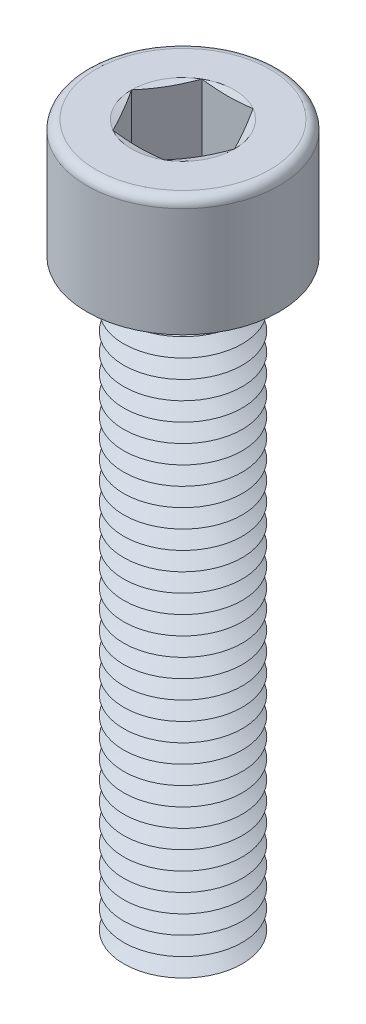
from build123d import *

# Parameters (mm, degrees)
SKETCH1_R       = 4
EXTRUDE1_DEPTH  = 40
SKETCH2_R       = 6.5
EXTRUDE2_DEPTH  = 8
EXTRUDE3_DEPTH  = 6
FILLET1_R       = 0.625
LPATTERN1_COUNT = 32
LPATTERN1_PITCH = 1.25


with BuildPart() as part:
    # Sketch1 → Extrude1 (new body)
    with BuildSketch(Plane(origin=(0, 0, 0), x_dir=(1, 0, 0), z_dir=(0, 1, 0))):
        with Locations(Location((0, 0, 0), (0, 0, 270))):
            Circle(SKETCH1_R)
    extrude(amount=EXTRUDE1_DEPTH)

    # Sketch2 → Extrude2 (add)
    with BuildSketch(Plane(origin=(0, 40, 0), x_dir=(1, 0, 0), z_dir=(0, 1, 0))):
        with Locations(Location((0, 0, 0), (0, 0, 270))):
            Circle(SKETCH2_R)
    extrude(amount=EXTRUDE2_DEPTH)

    # Sketch3 → Extrude3 (cut)
    with BuildSketch(Plane(origin=(0, 48, 0), x_dir=(1, 0, 0), z_dir=(0, 1, 0))):
        Polygon((1.732050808, 3), (-1.732050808, 3), (-3.464101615, 0), (-1.732050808, -3), (1.732050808, -3), (3.464101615, 0), align=None)
    extrude(amount=-EXTRUDE3_DEPTH, mode=Mode.SUBTRACT)

    # Fillet1
    fillet1_edges = [part.edges().sort_by_distance(p)[0] for p in [
        (0, 48, -6.5),
    ]]
    fillet(fillet1_edges, radius=FILLET1_R)

    # Sketch4 → Cut-Revolve1 (revolve, cut)
    with BuildSketch(Plane(origin=(0, 0, 0), x_dir=(0, 0, -1), z_dir=(1, 0, 0))):
        Polygon((-3, 42), (0, 42), (0, 40.267949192), align=None)
    revolve(axis=Axis((0, 42, 0), (0, -1, 0)), mode=Mode.SUBTRACT)

    # Sketch5 → Cut-Revolve2 (revolve, cut)
    with BuildSketch(Plane.XY, mode=Mode.PRIVATE) as cut_revolve2_sk:
        Polygon((-4, 0.625), (-4, -0.625), (-2.917468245, 0), align=None)
    cut_revolve2 = revolve(cut_revolve2_sk.sketch.rotate(Axis((0, 40, 0), (0, -1, 0)), 270), axis=Axis((0, 40, 0), (0, -1, 0)), mode=Mode.SUBTRACT)

    # LPattern1: Cut-Revolve2 ×32
    with Locations(*[(0, i * LPATTERN1_PITCH, 0) for i in range(1, LPATTERN1_COUNT)]):
        add(cut_revolve2, mode=Mode.SUBTRACT)

    # Extrude4 cone 1 section (on through the dimple's axis) → Extrude4 (revolve, cut)
    with BuildSketch(Plane(origin=(0, 48, 0), x_dir=(0, 0, 1), z_dir=(1, 0, 0))):
        Polygon((0, 0), (3.464101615, 0), (0, 0.92820323), align=None)
    revolve(axis=Axis((0, 48, 0), (0, -1, 0)), mode=Mode.SUBTRACT)


solid = part.part
